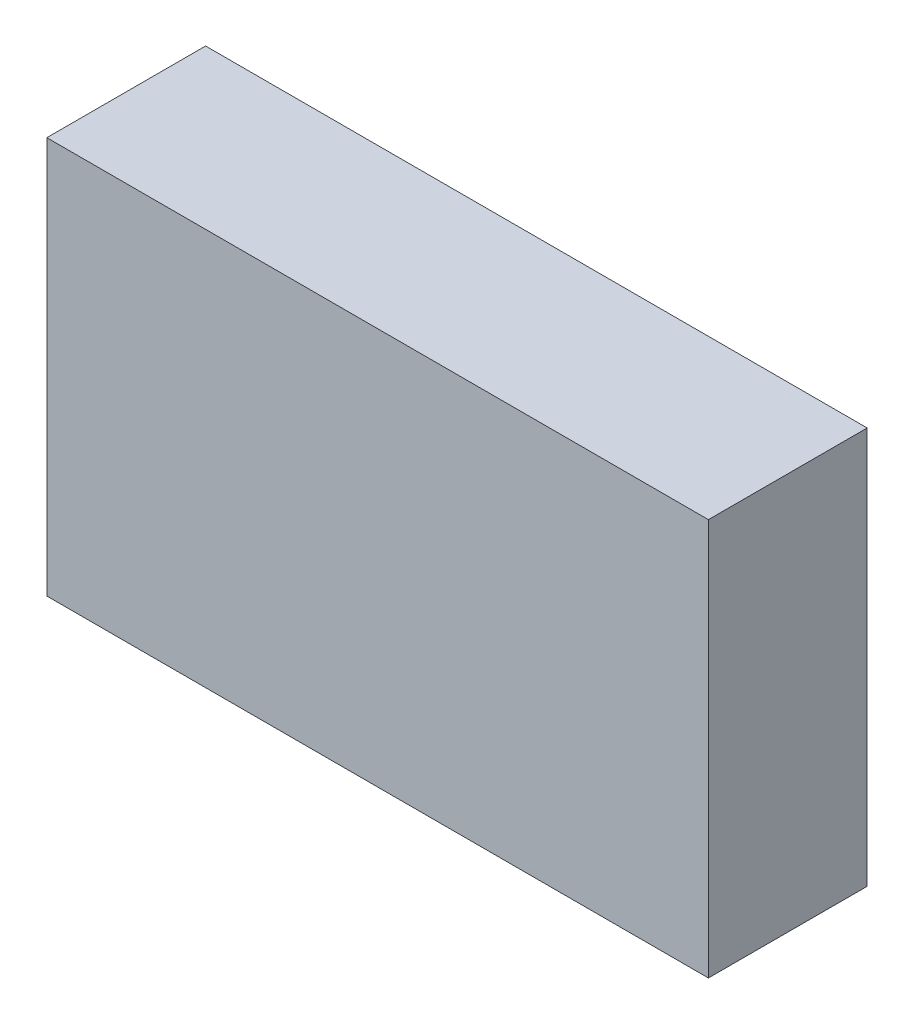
ISO-10303-21;
HEADER;
FILE_DESCRIPTION(('STEP AP214'),'2;1');
FILE_NAME('part.step','',(''),(''),'','','');
FILE_SCHEMA(('AUTOMOTIVE_DESIGN { 1 0 10303 214 1 1 1 1 }'));
ENDSEC;
DATA;
#1=APPLICATION_CONTEXT('core data for automotive mechanical design processes');
#2=APPLICATION_PROTOCOL_DEFINITION('international standard','automotive_design',2000,#1);
#3=PRODUCT_CONTEXT('',#1,'mechanical');
#4=PRODUCT('Part','Part','',(#3));
#5=PRODUCT_RELATED_PRODUCT_CATEGORY('part','',(#4));
#6=PRODUCT_DEFINITION_FORMATION('','',#4);
#7=PRODUCT_DEFINITION_CONTEXT('part definition',#1,'design');
#8=PRODUCT_DEFINITION('design','',#6,#7);
#9=PRODUCT_DEFINITION_SHAPE('','',#8);
#10=(LENGTH_UNIT() NAMED_UNIT(*) SI_UNIT(.MILLI.,.METRE.));
#11=(NAMED_UNIT(*) PLANE_ANGLE_UNIT() SI_UNIT($,.RADIAN.));
#12=(NAMED_UNIT(*) SI_UNIT($,.STERADIAN.) SOLID_ANGLE_UNIT());
#13=UNCERTAINTY_MEASURE_WITH_UNIT(LENGTH_MEASURE(1.E-05),#10,'distance_accuracy_value','');
#14=(GEOMETRIC_REPRESENTATION_CONTEXT(3) GLOBAL_UNCERTAINTY_ASSIGNED_CONTEXT((#13)) GLOBAL_UNIT_ASSIGNED_CONTEXT((#10,
#11,#12)) REPRESENTATION_CONTEXT('',''));
#15=CARTESIAN_POINT('',(0.,0.,0.));
#16=DIRECTION('',(0.,0.,1.));
#17=DIRECTION('',(1.,0.,0.));
#18=AXIS2_PLACEMENT_3D('',#15,#16,#17);
#19=CARTESIAN_POINT('',(0.,0.,6.));
#20=DIRECTION('',(0.,0.,1.));
#21=DIRECTION('',(1.,0.,0.));
#22=AXIS2_PLACEMENT_3D('',#19,#20,#21);
#23=PLANE('',#22);
#24=DIRECTION('',(-1.,0.,0.));
#25=VECTOR('',#24,1.);
#26=CARTESIAN_POINT('',(0.,-15.,6.));
#27=LINE('',#26,#25);
#28=CARTESIAN_POINT('',(25.,-15.,6.));
#29=VERTEX_POINT('',#28);
#30=CARTESIAN_POINT('',(-25.,-15.,6.));
#31=VERTEX_POINT('',#30);
#32=EDGE_CURVE('E11',#29,#31,#27,.T.);
#33=ORIENTED_EDGE('',*,*,#32,.F.);
#34=DIRECTION('',(0.,-1.,0.));
#35=VECTOR('',#34,1.);
#36=CARTESIAN_POINT('',(25.,0.,6.));
#37=LINE('',#36,#35);
#38=CARTESIAN_POINT('',(25.,15.,6.));
#39=VERTEX_POINT('',#38);
#40=EDGE_CURVE('E61',#39,#29,#37,.T.);
#41=ORIENTED_EDGE('',*,*,#40,.F.);
#42=DIRECTION('',(1.,0.,0.));
#43=VECTOR('',#42,1.);
#44=CARTESIAN_POINT('',(0.,15.,6.));
#45=LINE('',#44,#43);
#46=CARTESIAN_POINT('',(-25.,15.,6.));
#47=VERTEX_POINT('',#46);
#48=EDGE_CURVE('E87',#47,#39,#45,.T.);
#49=ORIENTED_EDGE('',*,*,#48,.F.);
#50=DIRECTION('',(0.,1.,0.));
#51=VECTOR('',#50,1.);
#52=CARTESIAN_POINT('',(-25.,0.,6.));
#53=LINE('',#52,#51);
#54=EDGE_CURVE('E24',#31,#47,#53,.T.);
#55=ORIENTED_EDGE('',*,*,#54,.F.);
#56=EDGE_LOOP('',(#33,#41,#49,#55));
#57=FACE_BOUND('',#56,.T.);
#58=ADVANCED_FACE('F17',(#57),#23,.T.);
#59=CARTESIAN_POINT('',(0.,-15.,-6.));
#60=DIRECTION('',(0.,-1.,0.));
#61=DIRECTION('',(0.,0.,-1.));
#62=AXIS2_PLACEMENT_3D('',#59,#60,#61);
#63=PLANE('',#62);
#64=DIRECTION('',(0.,0.,1.));
#65=VECTOR('',#64,1.);
#66=CARTESIAN_POINT('',(25.,-15.,-6.));
#67=LINE('',#66,#65);
#68=CARTESIAN_POINT('',(25.,-15.,-6.));
#69=VERTEX_POINT('',#68);
#70=EDGE_CURVE('E53',#69,#29,#67,.T.);
#71=ORIENTED_EDGE('',*,*,#70,.T.);
#72=ORIENTED_EDGE('',*,*,#32,.T.);
#73=DIRECTION('',(0.,0.,1.));
#74=VECTOR('',#73,1.);
#75=CARTESIAN_POINT('',(-25.,-15.,-6.));
#76=LINE('',#75,#74);
#77=CARTESIAN_POINT('',(-25.,-15.,-6.));
#78=VERTEX_POINT('',#77);
#79=EDGE_CURVE('E70',#78,#31,#76,.T.);
#80=ORIENTED_EDGE('',*,*,#79,.F.);
#81=DIRECTION('',(1.,0.,0.));
#82=VECTOR('',#81,1.);
#83=CARTESIAN_POINT('',(0.,-15.,-6.));
#84=LINE('',#83,#82);
#85=EDGE_CURVE('E65',#78,#69,#84,.T.);
#86=ORIENTED_EDGE('',*,*,#85,.T.);
#87=EDGE_LOOP('',(#71,#72,#80,#86));
#88=FACE_BOUND('',#87,.T.);
#89=ADVANCED_FACE('F66',(#88),#63,.T.);
#90=CARTESIAN_POINT('',(-25.,0.,-6.));
#91=DIRECTION('',(-1.,0.,0.));
#92=DIRECTION('',(0.,0.,1.));
#93=AXIS2_PLACEMENT_3D('',#90,#91,#92);
#94=PLANE('',#93);
#95=ORIENTED_EDGE('',*,*,#79,.T.);
#96=ORIENTED_EDGE('',*,*,#54,.T.);
#97=DIRECTION('',(0.,0.,1.));
#98=VECTOR('',#97,1.);
#99=CARTESIAN_POINT('',(-25.,15.,-6.));
#100=LINE('',#99,#98);
#101=CARTESIAN_POINT('',(-25.,15.,-6.));
#102=VERTEX_POINT('',#101);
#103=EDGE_CURVE('E85',#102,#47,#100,.T.);
#104=ORIENTED_EDGE('',*,*,#103,.F.);
#105=DIRECTION('',(0.,-1.,0.));
#106=VECTOR('',#105,1.);
#107=CARTESIAN_POINT('',(-25.,0.,-6.));
#108=LINE('',#107,#106);
#109=EDGE_CURVE('E75',#102,#78,#108,.T.);
#110=ORIENTED_EDGE('',*,*,#109,.T.);
#111=EDGE_LOOP('',(#95,#96,#104,#110));
#112=FACE_BOUND('',#111,.T.);
#113=ADVANCED_FACE('F93',(#112),#94,.T.);
#114=CARTESIAN_POINT('',(0.,15.,-6.));
#115=DIRECTION('',(0.,1.,0.));
#116=DIRECTION('',(0.,0.,1.));
#117=AXIS2_PLACEMENT_3D('',#114,#115,#116);
#118=PLANE('',#117);
#119=ORIENTED_EDGE('',*,*,#103,.T.);
#120=ORIENTED_EDGE('',*,*,#48,.T.);
#121=DIRECTION('',(0.,0.,1.));
#122=VECTOR('',#121,1.);
#123=CARTESIAN_POINT('',(25.,15.,-6.));
#124=LINE('',#123,#122);
#125=CARTESIAN_POINT('',(25.,15.,-6.));
#126=VERTEX_POINT('',#125);
#127=EDGE_CURVE('E62',#126,#39,#124,.T.);
#128=ORIENTED_EDGE('',*,*,#127,.F.);
#129=DIRECTION('',(-1.,0.,0.));
#130=VECTOR('',#129,1.);
#131=CARTESIAN_POINT('',(0.,15.,-6.));
#132=LINE('',#131,#130);
#133=EDGE_CURVE('E76',#126,#102,#132,.T.);
#134=ORIENTED_EDGE('',*,*,#133,.T.);
#135=EDGE_LOOP('',(#119,#120,#128,#134));
#136=FACE_BOUND('',#135,.T.);
#137=ADVANCED_FACE('F90',(#136),#118,.T.);
#138=CARTESIAN_POINT('',(0.,0.,-6.));
#139=DIRECTION('',(0.,0.,-1.));
#140=DIRECTION('',(-1.,0.,0.));
#141=AXIS2_PLACEMENT_3D('',#138,#139,#140);
#142=PLANE('',#141);
#143=DIRECTION('',(0.,1.,0.));
#144=VECTOR('',#143,1.);
#145=CARTESIAN_POINT('',(25.,0.,-6.));
#146=LINE('',#145,#144);
#147=EDGE_CURVE('E56',#69,#126,#146,.T.);
#148=ORIENTED_EDGE('',*,*,#147,.F.);
#149=ORIENTED_EDGE('',*,*,#85,.F.);
#150=ORIENTED_EDGE('',*,*,#109,.F.);
#151=ORIENTED_EDGE('',*,*,#133,.F.);
#152=EDGE_LOOP('',(#148,#149,#150,#151));
#153=FACE_BOUND('',#152,.T.);
#154=ADVANCED_FACE('F72',(#153),#142,.T.);
#155=CARTESIAN_POINT('',(25.,0.,-6.));
#156=DIRECTION('',(1.,0.,0.));
#157=DIRECTION('',(0.,0.,-1.));
#158=AXIS2_PLACEMENT_3D('',#155,#156,#157);
#159=PLANE('',#158);
#160=ORIENTED_EDGE('',*,*,#147,.T.);
#161=ORIENTED_EDGE('',*,*,#127,.T.);
#162=ORIENTED_EDGE('',*,*,#40,.T.);
#163=ORIENTED_EDGE('',*,*,#70,.F.);
#164=EDGE_LOOP('',(#160,#161,#162,#163));
#165=FACE_BOUND('',#164,.T.);
#166=ADVANCED_FACE('F57',(#165),#159,.T.);
#167=CLOSED_SHELL('',(#58,#89,#113,#137,#154,#166));
#168=MANIFOLD_SOLID_BREP('B1',#167);
#169=ADVANCED_BREP_SHAPE_REPRESENTATION('',(#18,#168),#14);
#170=SHAPE_DEFINITION_REPRESENTATION(#9,#169);
ENDSEC;
END-ISO-10303-21;
